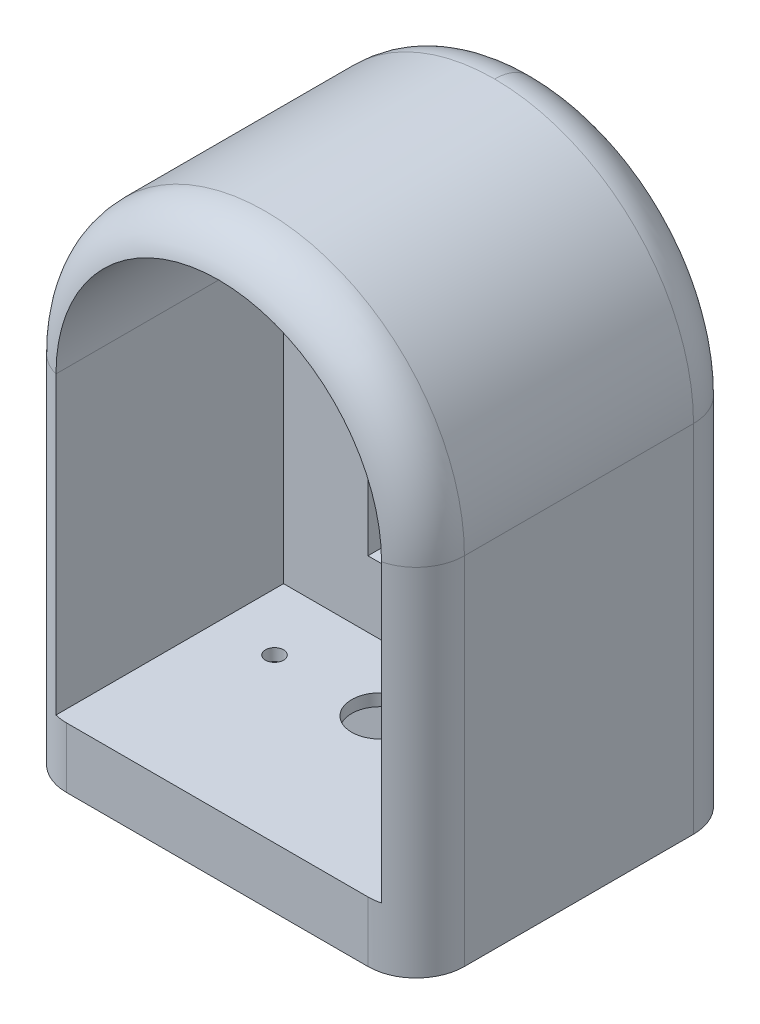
ISO-10303-21;
HEADER;
FILE_DESCRIPTION(('STEP AP214'),'2;1');
FILE_NAME('part.step','',(''),(''),'','','');
FILE_SCHEMA(('AUTOMOTIVE_DESIGN { 1 0 10303 214 1 1 1 1 }'));
ENDSEC;
DATA;
#1=APPLICATION_CONTEXT('core data for automotive mechanical design processes');
#2=APPLICATION_PROTOCOL_DEFINITION('international standard','automotive_design',2000,#1);
#3=PRODUCT_CONTEXT('',#1,'mechanical');
#4=PRODUCT('Part','Part','',(#3));
#5=PRODUCT_RELATED_PRODUCT_CATEGORY('part','',(#4));
#6=PRODUCT_DEFINITION_FORMATION('','',#4);
#7=PRODUCT_DEFINITION_CONTEXT('part definition',#1,'design');
#8=PRODUCT_DEFINITION('design','',#6,#7);
#9=PRODUCT_DEFINITION_SHAPE('','',#8);
#10=(LENGTH_UNIT() NAMED_UNIT(*) SI_UNIT(.MILLI.,.METRE.));
#11=(NAMED_UNIT(*) PLANE_ANGLE_UNIT() SI_UNIT($,.RADIAN.));
#12=(NAMED_UNIT(*) SI_UNIT($,.STERADIAN.) SOLID_ANGLE_UNIT());
#13=UNCERTAINTY_MEASURE_WITH_UNIT(LENGTH_MEASURE(1.E-05),#10,'distance_accuracy_value','');
#14=(GEOMETRIC_REPRESENTATION_CONTEXT(3) GLOBAL_UNCERTAINTY_ASSIGNED_CONTEXT((#13)) GLOBAL_UNIT_ASSIGNED_CONTEXT((#10,
#11,#12)) REPRESENTATION_CONTEXT('',''));
#15=CARTESIAN_POINT('',(0.,0.,0.));
#16=DIRECTION('',(0.,0.,1.));
#17=DIRECTION('',(1.,0.,0.));
#18=AXIS2_PLACEMENT_3D('',#15,#16,#17);
#19=CARTESIAN_POINT('',(-16.5,46.,-13.5));
#20=DIRECTION('',(0.,0.,1.));
#21=DIRECTION('',(1.,0.,0.));
#22=AXIS2_PLACEMENT_3D('',#19,#20,#21);
#23=PLANE('',#22);
#24=CARTESIAN_POINT('',(0.,36.35,-13.5));
#25=DIRECTION('',(0.,0.,1.));
#26=DIRECTION('',(1.,0.,0.));
#27=AXIS2_PLACEMENT_3D('',#24,#25,#26);
#28=CIRCLE('',#27,0.799999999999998);
#29=CARTESIAN_POINT('',(0.799999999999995,36.35,-13.5));
#30=VERTEX_POINT('',#29);
#31=EDGE_CURVE('E483',#30,#30,#28,.T.);
#32=ORIENTED_EDGE('',*,*,#31,.T.);
#33=EDGE_LOOP('',(#32));
#34=FACE_BOUND('',#33,.T.);
#35=CARTESIAN_POINT('',(0.,8.64999999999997,-13.5));
#36=DIRECTION('',(0.,0.,1.));
#37=DIRECTION('',(1.,0.,0.));
#38=AXIS2_PLACEMENT_3D('',#35,#36,#37);
#39=CIRCLE('',#38,0.799999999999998);
#40=CARTESIAN_POINT('',(0.799999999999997,8.64999999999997,-13.5));
#41=VERTEX_POINT('',#40);
#42=EDGE_CURVE('E489',#41,#41,#39,.T.);
#43=ORIENTED_EDGE('',*,*,#42,.T.);
#44=EDGE_LOOP('',(#43));
#45=FACE_BOUND('',#44,.T.);
#46=DIRECTION('',(-1.,0.,0.));
#47=VECTOR('',#46,1.);
#48=CARTESIAN_POINT('',(-16.5,0.,-13.5));
#49=LINE('',#48,#47);
#50=CARTESIAN_POINT('',(12.5,0.,-13.5));
#51=VERTEX_POINT('',#50);
#52=CARTESIAN_POINT('',(-12.5,0.,-13.5));
#53=VERTEX_POINT('',#52);
#54=EDGE_CURVE('E178',#51,#53,#49,.T.);
#55=ORIENTED_EDGE('',*,*,#54,.T.);
#56=DIRECTION('',(0.,-1.,0.));
#57=VECTOR('',#56,1.);
#58=CARTESIAN_POINT('',(-12.5,46.,-13.5));
#59=LINE('',#58,#57);
#60=CARTESIAN_POINT('',(-12.5,29.5,-13.5));
#61=VERTEX_POINT('',#60);
#62=EDGE_CURVE('E237',#53,#61,#59,.F.);
#63=ORIENTED_EDGE('',*,*,#62,.T.);
#64=CARTESIAN_POINT('',(0.,29.5,-13.5));
#65=DIRECTION('',(0.,0.,1.));
#66=DIRECTION('',(1.,0.,0.));
#67=AXIS2_PLACEMENT_3D('',#64,#65,#66);
#68=CIRCLE('',#67,12.5);
#69=CARTESIAN_POINT('',(0.,42.,-13.5));
#70=VERTEX_POINT('',#69);
#71=EDGE_CURVE('E228',#61,#70,#68,.F.);
#72=ORIENTED_EDGE('',*,*,#71,.T.);
#73=CARTESIAN_POINT('',(0.,29.5,-13.5));
#74=DIRECTION('',(0.,0.,1.));
#75=DIRECTION('',(1.,0.,0.));
#76=AXIS2_PLACEMENT_3D('',#73,#74,#75);
#77=CIRCLE('',#76,12.5);
#78=CARTESIAN_POINT('',(12.5,29.5,-13.5));
#79=VERTEX_POINT('',#78);
#80=EDGE_CURVE('E231',#70,#79,#77,.F.);
#81=ORIENTED_EDGE('',*,*,#80,.T.);
#82=DIRECTION('',(0.,-1.,0.));
#83=VECTOR('',#82,1.);
#84=CARTESIAN_POINT('',(12.5,46.,-13.5));
#85=LINE('',#84,#83);
#86=EDGE_CURVE('E234',#79,#51,#85,.T.);
#87=ORIENTED_EDGE('',*,*,#86,.T.);
#88=EDGE_LOOP('',(#55,#63,#72,#81,#87));
#89=FACE_BOUND('',#88,.T.);
#90=CARTESIAN_POINT('',(0.,28.,-13.5));
#91=DIRECTION('',(0.,0.,1.));
#92=DIRECTION('',(1.,0.,0.));
#93=AXIS2_PLACEMENT_3D('',#90,#91,#92);
#94=CIRCLE('',#93,6.49999999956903);
#95=CARTESIAN_POINT('',(2.59999999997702,22.0426515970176,-13.5));
#96=VERTEX_POINT('',#95);
#97=CARTESIAN_POINT('',(-2.59999999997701,22.0426515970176,-13.5));
#98=VERTEX_POINT('',#97);
#99=EDGE_CURVE('E131',#96,#98,#94,.T.);
#100=ORIENTED_EDGE('',*,*,#99,.T.);
#101=CARTESIAN_POINT('',(-3.,21.1261364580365,-13.5));
#102=DIRECTION('',(0.,0.,1.));
#103=DIRECTION('',(1.,0.,0.));
#104=AXIS2_PLACEMENT_3D('',#101,#102,#103);
#105=CIRCLE('',#104,1.);
#106=CARTESIAN_POINT('',(-2.,21.1261364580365,-13.5));
#107=VERTEX_POINT('',#106);
#108=EDGE_CURVE('E59',#98,#107,#105,.F.);
#109=ORIENTED_EDGE('',*,*,#108,.T.);
#110=DIRECTION('',(0.,1.,0.));
#111=VECTOR('',#110,1.);
#112=CARTESIAN_POINT('',(-1.99999999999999,46.,-13.5));
#113=LINE('',#112,#111);
#114=CARTESIAN_POINT('',(-2.,20.500000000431,-13.5));
#115=VERTEX_POINT('',#114);
#116=EDGE_CURVE('E338',#115,#107,#113,.T.);
#117=ORIENTED_EDGE('',*,*,#116,.F.);
#118=CARTESIAN_POINT('',(0.,20.500000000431,-13.5));
#119=DIRECTION('',(0.,0.,1.));
#120=DIRECTION('',(1.,0.,0.));
#121=AXIS2_PLACEMENT_3D('',#118,#119,#120);
#122=CIRCLE('',#121,2.);
#123=CARTESIAN_POINT('',(2.,20.500000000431,-13.5));
#124=VERTEX_POINT('',#123);
#125=EDGE_CURVE('E341',#124,#115,#122,.F.);
#126=ORIENTED_EDGE('',*,*,#125,.F.);
#127=DIRECTION('',(0.,-1.,0.));
#128=VECTOR('',#127,1.);
#129=CARTESIAN_POINT('',(2.00000000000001,46.,-13.5));
#130=LINE('',#129,#128);
#131=CARTESIAN_POINT('',(2.,21.1261364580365,-13.5));
#132=VERTEX_POINT('',#131);
#133=EDGE_CURVE('E135',#132,#124,#130,.T.);
#134=ORIENTED_EDGE('',*,*,#133,.F.);
#135=CARTESIAN_POINT('',(3.,21.1261364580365,-13.5));
#136=DIRECTION('',(0.,0.,1.));
#137=DIRECTION('',(1.,0.,0.));
#138=AXIS2_PLACEMENT_3D('',#135,#136,#137);
#139=CIRCLE('',#138,1.);
#140=EDGE_CURVE('E68',#132,#96,#139,.F.);
#141=ORIENTED_EDGE('',*,*,#140,.T.);
#142=EDGE_LOOP('',(#100,#109,#117,#126,#134,#141));
#143=FACE_BOUND('',#142,.T.);
#144=ADVANCED_FACE('F49',(#34,#45,#89,#143),#23,.F.);
#145=CARTESIAN_POINT('',(0.,0.,-10.5));
#146=DIRECTION('',(0.,0.,-1.));
#147=DIRECTION('',(-1.,0.,0.));
#148=AXIS2_PLACEMENT_3D('',#145,#146,#147);
#149=PLANE('',#148);
#150=DIRECTION('',(0.,-1.,0.));
#151=VECTOR('',#150,1.);
#152=CARTESIAN_POINT('',(-2.,0.,-10.5));
#153=LINE('',#152,#151);
#154=CARTESIAN_POINT('',(-2.,21.1261364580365,-10.5));
#155=VERTEX_POINT('',#154);
#156=CARTESIAN_POINT('',(-2.,20.500000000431,-10.5));
#157=VERTEX_POINT('',#156);
#158=EDGE_CURVE('E330',#155,#157,#153,.T.);
#159=ORIENTED_EDGE('',*,*,#158,.F.);
#160=CARTESIAN_POINT('',(-3.,21.1261364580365,-10.5));
#161=DIRECTION('',(0.,0.,-1.));
#162=DIRECTION('',(-1.,0.,0.));
#163=AXIS2_PLACEMENT_3D('',#160,#161,#162);
#164=CIRCLE('',#163,1.);
#165=CARTESIAN_POINT('',(-2.59999999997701,22.0426515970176,-10.5));
#166=VERTEX_POINT('',#165);
#167=EDGE_CURVE('E149',#155,#166,#164,.F.);
#168=ORIENTED_EDGE('',*,*,#167,.T.);
#169=CARTESIAN_POINT('',(0.,28.,-10.5));
#170=DIRECTION('',(0.,0.,-1.));
#171=DIRECTION('',(-1.,0.,0.));
#172=AXIS2_PLACEMENT_3D('',#169,#170,#171);
#173=CIRCLE('',#172,6.49999999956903);
#174=CARTESIAN_POINT('',(-6.5,28.,-10.5));
#175=VERTEX_POINT('',#174);
#176=EDGE_CURVE('E291',#175,#166,#173,.F.);
#177=ORIENTED_EDGE('',*,*,#176,.F.);
#178=DIRECTION('',(0.,-1.,0.));
#179=VECTOR('',#178,1.);
#180=CARTESIAN_POINT('',(-6.5,11.5,-10.5));
#181=LINE('',#180,#179);
#182=CARTESIAN_POINT('',(-6.5,10.5,-10.5));
#183=VERTEX_POINT('',#182);
#184=EDGE_CURVE('E301',#175,#183,#181,.T.);
#185=ORIENTED_EDGE('',*,*,#184,.T.);
#186=DIRECTION('',(1.,0.,0.));
#187=VECTOR('',#186,1.);
#188=CARTESIAN_POINT('',(6.5,10.5,-10.5));
#189=LINE('',#188,#187);
#190=CARTESIAN_POINT('',(6.5,10.5,-10.5));
#191=VERTEX_POINT('',#190);
#192=EDGE_CURVE('E473',#183,#191,#189,.T.);
#193=ORIENTED_EDGE('',*,*,#192,.T.);
#194=DIRECTION('',(0.,1.,0.));
#195=VECTOR('',#194,1.);
#196=CARTESIAN_POINT('',(6.5,11.5,-10.5));
#197=LINE('',#196,#195);
#198=CARTESIAN_POINT('',(6.5,28.,-10.5));
#199=VERTEX_POINT('',#198);
#200=EDGE_CURVE('E298',#191,#199,#197,.T.);
#201=ORIENTED_EDGE('',*,*,#200,.T.);
#202=CARTESIAN_POINT('',(2.59999999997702,22.0426515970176,-10.5));
#203=VERTEX_POINT('',#202);
#204=EDGE_CURVE('E293',#203,#199,#173,.F.);
#205=ORIENTED_EDGE('',*,*,#204,.F.);
#206=CARTESIAN_POINT('',(3.,21.1261364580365,-10.5));
#207=DIRECTION('',(0.,0.,-1.));
#208=DIRECTION('',(-1.,0.,0.));
#209=AXIS2_PLACEMENT_3D('',#206,#207,#208);
#210=CIRCLE('',#209,1.);
#211=CARTESIAN_POINT('',(2.,21.1261364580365,-10.5));
#212=VERTEX_POINT('',#211);
#213=EDGE_CURVE('E148',#203,#212,#210,.F.);
#214=ORIENTED_EDGE('',*,*,#213,.T.);
#215=DIRECTION('',(0.,1.,0.));
#216=VECTOR('',#215,1.);
#217=CARTESIAN_POINT('',(2.,0.,-10.5));
#218=LINE('',#217,#216);
#219=CARTESIAN_POINT('',(2.,20.500000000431,-10.5));
#220=VERTEX_POINT('',#219);
#221=EDGE_CURVE('E322',#220,#212,#218,.T.);
#222=ORIENTED_EDGE('',*,*,#221,.F.);
#223=CARTESIAN_POINT('',(0.,20.500000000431,-10.5));
#224=DIRECTION('',(0.,0.,-1.));
#225=DIRECTION('',(-1.,0.,0.));
#226=AXIS2_PLACEMENT_3D('',#223,#224,#225);
#227=CIRCLE('',#226,2.);
#228=EDGE_CURVE('E273',#157,#220,#227,.F.);
#229=ORIENTED_EDGE('',*,*,#228,.F.);
#230=EDGE_LOOP('',(#159,#168,#177,#185,#193,#201,#205,#214,#222,#229));
#231=FACE_BOUND('',#230,.T.);
#232=ADVANCED_FACE('F319',(#231),#149,.F.);
#233=CARTESIAN_POINT('',(0.,28.,-13.5));
#234=DIRECTION('',(0.,0.,1.));
#235=DIRECTION('',(1.,0.,0.));
#236=AXIS2_PLACEMENT_3D('',#233,#234,#235);
#237=CYLINDRICAL_SURFACE('',#236,6.49999999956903);
#238=ORIENTED_EDGE('',*,*,#176,.T.);
#239=DIRECTION('',(0.,0.,1.));
#240=VECTOR('',#239,1.);
#241=CARTESIAN_POINT('',(-2.59999999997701,22.0426515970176,-13.5));
#242=LINE('',#241,#240);
#243=EDGE_CURVE('E136',#166,#98,#242,.F.);
#244=ORIENTED_EDGE('',*,*,#243,.T.);
#245=ORIENTED_EDGE('',*,*,#99,.F.);
#246=DIRECTION('',(0.,0.,1.));
#247=VECTOR('',#246,1.);
#248=CARTESIAN_POINT('',(2.59999999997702,22.0426515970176,-13.5));
#249=LINE('',#248,#247);
#250=EDGE_CURVE('E140',#96,#203,#249,.T.);
#251=ORIENTED_EDGE('',*,*,#250,.T.);
#252=ORIENTED_EDGE('',*,*,#204,.T.);
#253=CARTESIAN_POINT('',(0.,28.,-10.5));
#254=DIRECTION('',(0.,0.,-1.));
#255=DIRECTION('',(-1.,0.,0.));
#256=AXIS2_PLACEMENT_3D('',#253,#254,#255);
#257=CIRCLE('',#256,6.49999999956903);
#258=CARTESIAN_POINT('',(0.,34.5,-10.5));
#259=VERTEX_POINT('',#258);
#260=EDGE_CURVE('E144',#199,#259,#257,.F.);
#261=ORIENTED_EDGE('',*,*,#260,.T.);
#262=CARTESIAN_POINT('',(0.,28.,-10.5));
#263=DIRECTION('',(0.,0.,-1.));
#264=DIRECTION('',(-1.,0.,0.));
#265=AXIS2_PLACEMENT_3D('',#262,#263,#264);
#266=CIRCLE('',#265,6.49999999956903);
#267=EDGE_CURVE('E103',#259,#175,#266,.F.);
#268=ORIENTED_EDGE('',*,*,#267,.T.);
#269=EDGE_LOOP('',(#238,#244,#245,#251,#252,#261,#268));
#270=FACE_BOUND('',#269,.T.);
#271=ADVANCED_FACE('F138',(#270),#237,.F.);
#272=CARTESIAN_POINT('',(-16.5,0.,-5.5));
#273=DIRECTION('',(0.,0.,1.));
#274=DIRECTION('',(0.,-1.,0.));
#275=AXIS2_PLACEMENT_3D('',#272,#273,#274);
#276=PLANE('',#275);
#277=DIRECTION('',(1.,0.,0.));
#278=VECTOR('',#277,1.);
#279=CARTESIAN_POINT('',(6.5,10.5,-5.5));
#280=LINE('',#279,#278);
#281=CARTESIAN_POINT('',(-6.5,10.5,-5.5));
#282=VERTEX_POINT('',#281);
#283=CARTESIAN_POINT('',(6.5,10.5,-5.5));
#284=VERTEX_POINT('',#283);
#285=EDGE_CURVE('E460',#282,#284,#280,.T.);
#286=ORIENTED_EDGE('',*,*,#285,.F.);
#287=DIRECTION('',(0.,-1.,0.));
#288=VECTOR('',#287,1.);
#289=CARTESIAN_POINT('',(-6.5,0.,-5.5));
#290=LINE('',#289,#288);
#291=CARTESIAN_POINT('',(-6.5,34.5,-5.5));
#292=VERTEX_POINT('',#291);
#293=EDGE_CURVE('E160',#292,#282,#290,.T.);
#294=ORIENTED_EDGE('',*,*,#293,.F.);
#295=DIRECTION('',(-1.,0.,0.));
#296=VECTOR('',#295,1.);
#297=CARTESIAN_POINT('',(-16.5,34.5,-5.5));
#298=LINE('',#297,#296);
#299=CARTESIAN_POINT('',(6.5,34.5,-5.5));
#300=VERTEX_POINT('',#299);
#301=EDGE_CURVE('E157',#300,#292,#298,.T.);
#302=ORIENTED_EDGE('',*,*,#301,.F.);
#303=DIRECTION('',(0.,1.,0.));
#304=VECTOR('',#303,1.);
#305=CARTESIAN_POINT('',(6.5,0.,-5.5));
#306=LINE('',#305,#304);
#307=EDGE_CURVE('E143',#284,#300,#306,.T.);
#308=ORIENTED_EDGE('',*,*,#307,.F.);
#309=EDGE_LOOP('',(#286,#294,#302,#308));
#310=FACE_BOUND('',#309,.T.);
#311=CARTESIAN_POINT('',(0.,36.35,-5.5));
#312=DIRECTION('',(0.,0.,1.));
#313=DIRECTION('',(1.,0.,0.));
#314=AXIS2_PLACEMENT_3D('',#311,#312,#313);
#315=CIRCLE('',#314,0.799999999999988);
#316=CARTESIAN_POINT('',(0.799999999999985,36.35,-5.5));
#317=VERTEX_POINT('',#316);
#318=EDGE_CURVE('E480',#317,#317,#315,.T.);
#319=ORIENTED_EDGE('',*,*,#318,.F.);
#320=EDGE_LOOP('',(#319));
#321=FACE_BOUND('',#320,.T.);
#322=CARTESIAN_POINT('',(0.,8.64999999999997,-5.5));
#323=DIRECTION('',(0.,0.,1.));
#324=DIRECTION('',(1.,0.,0.));
#325=AXIS2_PLACEMENT_3D('',#322,#323,#324);
#326=CIRCLE('',#325,0.799999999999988);
#327=CARTESIAN_POINT('',(0.799999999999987,8.64999999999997,-5.5));
#328=VERTEX_POINT('',#327);
#329=EDGE_CURVE('E486',#328,#328,#326,.T.);
#330=ORIENTED_EDGE('',*,*,#329,.F.);
#331=EDGE_LOOP('',(#330));
#332=FACE_BOUND('',#331,.T.);
#333=CARTESIAN_POINT('',(0.,29.5,-5.5));
#334=DIRECTION('',(0.,0.,1.));
#335=DIRECTION('',(0.,-1.,0.));
#336=AXIS2_PLACEMENT_3D('',#333,#334,#335);
#337=CIRCLE('',#336,13.5);
#338=CARTESIAN_POINT('',(-13.5,29.5,-5.5));
#339=VERTEX_POINT('',#338);
#340=CARTESIAN_POINT('',(13.5,29.5,-5.5));
#341=VERTEX_POINT('',#340);
#342=EDGE_CURVE('E164',#339,#341,#337,.F.);
#343=ORIENTED_EDGE('',*,*,#342,.F.);
#344=DIRECTION('',(0.,1.,0.));
#345=VECTOR('',#344,1.);
#346=CARTESIAN_POINT('',(-13.5,29.5,-5.5));
#347=LINE('',#346,#345);
#348=CARTESIAN_POINT('',(-13.5,5.,-5.5));
#349=VERTEX_POINT('',#348);
#350=EDGE_CURVE('E53',#349,#339,#347,.T.);
#351=ORIENTED_EDGE('',*,*,#350,.F.);
#352=DIRECTION('',(1.,0.,0.));
#353=VECTOR('',#352,1.);
#354=CARTESIAN_POINT('',(-16.5,5.,-5.5));
#355=LINE('',#354,#353);
#356=CARTESIAN_POINT('',(13.5,5.,-5.5));
#357=VERTEX_POINT('',#356);
#358=EDGE_CURVE('E170',#349,#357,#355,.T.);
#359=ORIENTED_EDGE('',*,*,#358,.T.);
#360=DIRECTION('',(0.,-1.,0.));
#361=VECTOR('',#360,1.);
#362=CARTESIAN_POINT('',(13.5,5.,-5.5));
#363=LINE('',#362,#361);
#364=EDGE_CURVE('E167',#341,#357,#363,.T.);
#365=ORIENTED_EDGE('',*,*,#364,.F.);
#366=EDGE_LOOP('',(#343,#351,#359,#365));
#367=FACE_BOUND('',#366,.T.);
#368=ADVANCED_FACE('F51',(#310,#321,#332,#367),#276,.T.);
#369=CARTESIAN_POINT('',(-16.5,5.,0.));
#370=DIRECTION('',(0.,-1.,0.));
#371=DIRECTION('',(0.,0.,-1.));
#372=AXIS2_PLACEMENT_3D('',#369,#370,#371);
#373=PLANE('',#372);
#374=CARTESIAN_POINT('',(-8.75,5.,0.));
#375=DIRECTION('',(0.,-1.,0.));
#376=DIRECTION('',(0.,0.,-1.));
#377=AXIS2_PLACEMENT_3D('',#374,#375,#376);
#378=CIRCLE('',#377,0.75);
#379=CARTESIAN_POINT('',(-8.75,5.,-0.750000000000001));
#380=VERTEX_POINT('',#379);
#381=EDGE_CURVE('E353',#380,#380,#378,.T.);
#382=ORIENTED_EDGE('',*,*,#381,.T.);
#383=EDGE_LOOP('',(#382));
#384=FACE_BOUND('',#383,.T.);
#385=CARTESIAN_POINT('',(8.75,5.,0.));
#386=DIRECTION('',(0.,-1.,0.));
#387=DIRECTION('',(0.,0.,-1.));
#388=AXIS2_PLACEMENT_3D('',#385,#386,#387);
#389=CIRCLE('',#388,0.75);
#390=CARTESIAN_POINT('',(8.75,5.,-0.75));
#391=VERTEX_POINT('',#390);
#392=EDGE_CURVE('E348',#391,#391,#389,.T.);
#393=ORIENTED_EDGE('',*,*,#392,.T.);
#394=EDGE_LOOP('',(#393));
#395=FACE_BOUND('',#394,.T.);
#396=CARTESIAN_POINT('',(0.,5.,0.));
#397=DIRECTION('',(0.,1.,0.));
#398=DIRECTION('',(0.,0.,1.));
#399=AXIS2_PLACEMENT_3D('',#396,#397,#398);
#400=CIRCLE('',#399,2.35);
#401=CARTESIAN_POINT('',(0.,5.,2.35));
#402=VERTEX_POINT('',#401);
#403=EDGE_CURVE('E356',#402,#402,#400,.T.);
#404=ORIENTED_EDGE('',*,*,#403,.F.);
#405=EDGE_LOOP('',(#404));
#406=FACE_BOUND('',#405,.T.);
#407=DIRECTION('',(1.,0.,0.));
#408=VECTOR('',#407,1.);
#409=CARTESIAN_POINT('',(-16.5,5.,13.5));
#410=LINE('',#409,#408);
#411=CARTESIAN_POINT('',(-12.5,5.,13.5));
#412=VERTEX_POINT('',#411);
#413=CARTESIAN_POINT('',(12.5,5.,13.5));
#414=VERTEX_POINT('',#413);
#415=EDGE_CURVE('E173',#412,#414,#410,.T.);
#416=ORIENTED_EDGE('',*,*,#415,.T.);
#417=CARTESIAN_POINT('',(12.5,5.,9.5));
#418=DIRECTION('',(0.,-1.,0.));
#419=DIRECTION('',(0.,0.,-1.));
#420=AXIS2_PLACEMENT_3D('',#417,#418,#419);
#421=CIRCLE('',#420,4.);
#422=CARTESIAN_POINT('',(13.5,5.,13.3729833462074));
#423=VERTEX_POINT('',#422);
#424=EDGE_CURVE('E263',#414,#423,#421,.F.);
#425=ORIENTED_EDGE('',*,*,#424,.T.);
#426=DIRECTION('',(0.,0.,-1.));
#427=VECTOR('',#426,1.);
#428=CARTESIAN_POINT('',(13.5,5.,13.5));
#429=LINE('',#428,#427);
#430=EDGE_CURVE('E169',#423,#357,#429,.T.);
#431=ORIENTED_EDGE('',*,*,#430,.T.);
#432=ORIENTED_EDGE('',*,*,#358,.F.);
#433=DIRECTION('',(0.,0.,-1.));
#434=VECTOR('',#433,1.);
#435=CARTESIAN_POINT('',(-13.5,5.,13.5));
#436=LINE('',#435,#434);
#437=CARTESIAN_POINT('',(-13.5,5.,13.3729833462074));
#438=VERTEX_POINT('',#437);
#439=EDGE_CURVE('E95',#438,#349,#436,.T.);
#440=ORIENTED_EDGE('',*,*,#439,.F.);
#441=CARTESIAN_POINT('',(-12.5,5.,9.5));
#442=DIRECTION('',(0.,-1.,0.));
#443=DIRECTION('',(0.,0.,-1.));
#444=AXIS2_PLACEMENT_3D('',#441,#442,#443);
#445=CIRCLE('',#444,4.);
#446=EDGE_CURVE('E261',#438,#412,#445,.F.);
#447=ORIENTED_EDGE('',*,*,#446,.T.);
#448=EDGE_LOOP('',(#416,#425,#431,#432,#440,#447));
#449=FACE_BOUND('',#448,.T.);
#450=ADVANCED_FACE('F503',(#384,#395,#406,#449),#373,.F.);
#451=ORIENTED_EDGE('',*,*,#260,.F.);
#452=DIRECTION('',(0.,1.,0.));
#453=VECTOR('',#452,1.);
#454=CARTESIAN_POINT('',(6.5,11.5,-10.5));
#455=LINE('',#454,#453);
#456=CARTESIAN_POINT('',(6.5,34.5,-10.5));
#457=VERTEX_POINT('',#456);
#458=EDGE_CURVE('E163',#199,#457,#455,.T.);
#459=ORIENTED_EDGE('',*,*,#458,.T.);
#460=DIRECTION('',(-1.,0.,0.));
#461=VECTOR('',#460,1.);
#462=CARTESIAN_POINT('',(-6.5,34.5,-10.5));
#463=LINE('',#462,#461);
#464=EDGE_CURVE('E297',#457,#259,#463,.T.);
#465=ORIENTED_EDGE('',*,*,#464,.T.);
#466=EDGE_LOOP('',(#451,#459,#465));
#467=FACE_BOUND('',#466,.T.);
#468=ADVANCED_FACE('F583',(#467),#149,.F.);
#469=ORIENTED_EDGE('',*,*,#267,.F.);
#470=DIRECTION('',(-1.,0.,0.));
#471=VECTOR('',#470,1.);
#472=CARTESIAN_POINT('',(-6.5,34.5,-10.5));
#473=LINE('',#472,#471);
#474=CARTESIAN_POINT('',(-6.5,34.5,-10.5));
#475=VERTEX_POINT('',#474);
#476=EDGE_CURVE('E295',#259,#475,#473,.T.);
#477=ORIENTED_EDGE('',*,*,#476,.T.);
#478=DIRECTION('',(0.,-1.,0.));
#479=VECTOR('',#478,1.);
#480=CARTESIAN_POINT('',(-6.5,11.5,-10.5));
#481=LINE('',#480,#479);
#482=EDGE_CURVE('E308',#475,#175,#481,.T.);
#483=ORIENTED_EDGE('',*,*,#482,.T.);
#484=EDGE_LOOP('',(#469,#477,#483));
#485=FACE_BOUND('',#484,.T.);
#486=ADVANCED_FACE('F674',(#485),#149,.F.);
#487=CARTESIAN_POINT('',(16.5,46.,13.5));
#488=DIRECTION('',(-1.,0.,0.));
#489=DIRECTION('',(0.,0.,1.));
#490=AXIS2_PLACEMENT_3D('',#487,#488,#489);
#491=PLANE('',#490);
#492=DIRECTION('',(0.,0.,-1.));
#493=VECTOR('',#492,1.);
#494=CARTESIAN_POINT('',(16.5,0.,13.5));
#495=LINE('',#494,#493);
#496=CARTESIAN_POINT('',(16.5,0.,9.5));
#497=VERTEX_POINT('',#496);
#498=CARTESIAN_POINT('',(16.5,0.,-9.5));
#499=VERTEX_POINT('',#498);
#500=EDGE_CURVE('E172',#497,#499,#495,.T.);
#501=ORIENTED_EDGE('',*,*,#500,.T.);
#502=DIRECTION('',(0.,-1.,0.));
#503=VECTOR('',#502,1.);
#504=CARTESIAN_POINT('',(16.5,46.,-9.5));
#505=LINE('',#504,#503);
#506=CARTESIAN_POINT('',(16.5,29.5,-9.5));
#507=VERTEX_POINT('',#506);
#508=EDGE_CURVE('E243',#499,#507,#505,.F.);
#509=ORIENTED_EDGE('',*,*,#508,.T.);
#510=DIRECTION('',(0.,0.,-1.));
#511=VECTOR('',#510,1.);
#512=CARTESIAN_POINT('',(16.5,29.5,13.5));
#513=LINE('',#512,#511);
#514=CARTESIAN_POINT('',(16.5,29.5,9.5));
#515=VERTEX_POINT('',#514);
#516=EDGE_CURVE('E207',#507,#515,#513,.F.);
#517=ORIENTED_EDGE('',*,*,#516,.T.);
#518=DIRECTION('',(0.,-1.,0.));
#519=VECTOR('',#518,1.);
#520=CARTESIAN_POINT('',(16.5,46.,9.5));
#521=LINE('',#520,#519);
#522=EDGE_CURVE('E240',#515,#497,#521,.T.);
#523=ORIENTED_EDGE('',*,*,#522,.T.);
#524=EDGE_LOOP('',(#501,#509,#517,#523));
#525=FACE_BOUND('',#524,.T.);
#526=ADVANCED_FACE('F539',(#525),#491,.F.);
#527=CARTESIAN_POINT('',(-16.5,46.,13.5));
#528=DIRECTION('',(1.,0.,0.));
#529=DIRECTION('',(0.,0.,-1.));
#530=AXIS2_PLACEMENT_3D('',#527,#528,#529);
#531=PLANE('',#530);
#532=DIRECTION('',(0.,0.,1.));
#533=VECTOR('',#532,1.);
#534=CARTESIAN_POINT('',(-16.5,29.5,13.5));
#535=LINE('',#534,#533);
#536=CARTESIAN_POINT('',(-16.5,29.5,9.5));
#537=VERTEX_POINT('',#536);
#538=CARTESIAN_POINT('',(-16.5,29.5,-9.5));
#539=VERTEX_POINT('',#538);
#540=EDGE_CURVE('E204',#537,#539,#535,.F.);
#541=ORIENTED_EDGE('',*,*,#540,.T.);
#542=DIRECTION('',(0.,-1.,0.));
#543=VECTOR('',#542,1.);
#544=CARTESIAN_POINT('',(-16.5,46.,-9.5));
#545=LINE('',#544,#543);
#546=CARTESIAN_POINT('',(-16.5,0.,-9.5));
#547=VERTEX_POINT('',#546);
#548=EDGE_CURVE('E213',#539,#547,#545,.T.);
#549=ORIENTED_EDGE('',*,*,#548,.T.);
#550=DIRECTION('',(0.,0.,1.));
#551=VECTOR('',#550,1.);
#552=CARTESIAN_POINT('',(-16.5,0.,13.5));
#553=LINE('',#552,#551);
#554=CARTESIAN_POINT('',(-16.5,0.,9.5));
#555=VERTEX_POINT('',#554);
#556=EDGE_CURVE('E198',#547,#555,#553,.T.);
#557=ORIENTED_EDGE('',*,*,#556,.T.);
#558=DIRECTION('',(0.,-1.,0.));
#559=VECTOR('',#558,1.);
#560=CARTESIAN_POINT('',(-16.5,46.,9.5));
#561=LINE('',#560,#559);
#562=EDGE_CURVE('E209',#555,#537,#561,.F.);
#563=ORIENTED_EDGE('',*,*,#562,.T.);
#564=EDGE_LOOP('',(#541,#549,#557,#563));
#565=FACE_BOUND('',#564,.T.);
#566=ADVANCED_FACE('F643',(#565),#531,.F.);
#567=CARTESIAN_POINT('',(-16.5,46.,13.5));
#568=DIRECTION('',(0.,0.,-1.));
#569=DIRECTION('',(-1.,0.,0.));
#570=AXIS2_PLACEMENT_3D('',#567,#568,#569);
#571=PLANE('',#570);
#572=DIRECTION('',(1.,0.,0.));
#573=VECTOR('',#572,1.);
#574=CARTESIAN_POINT('',(-16.5,0.,13.5));
#575=LINE('',#574,#573);
#576=CARTESIAN_POINT('',(-12.5,0.,13.5));
#577=VERTEX_POINT('',#576);
#578=CARTESIAN_POINT('',(12.5,0.,13.5));
#579=VERTEX_POINT('',#578);
#580=EDGE_CURVE('E201',#577,#579,#575,.T.);
#581=ORIENTED_EDGE('',*,*,#580,.T.);
#582=DIRECTION('',(0.,-1.,0.));
#583=VECTOR('',#582,1.);
#584=CARTESIAN_POINT('',(12.5,46.,13.5));
#585=LINE('',#584,#583);
#586=EDGE_CURVE('E258',#579,#414,#585,.F.);
#587=ORIENTED_EDGE('',*,*,#586,.T.);
#588=ORIENTED_EDGE('',*,*,#415,.F.);
#589=DIRECTION('',(0.,-1.,0.));
#590=VECTOR('',#589,1.);
#591=CARTESIAN_POINT('',(-12.5,46.,13.5));
#592=LINE('',#591,#590);
#593=EDGE_CURVE('E255',#412,#577,#592,.T.);
#594=ORIENTED_EDGE('',*,*,#593,.T.);
#595=EDGE_LOOP('',(#581,#587,#588,#594));
#596=FACE_BOUND('',#595,.T.);
#597=ADVANCED_FACE('F686',(#596),#571,.F.);
#598=CARTESIAN_POINT('',(0.,0.,0.));
#599=DIRECTION('',(0.,-1.,0.));
#600=DIRECTION('',(0.,0.,-1.));
#601=AXIS2_PLACEMENT_3D('',#598,#599,#600);
#602=PLANE('',#601);
#603=CARTESIAN_POINT('',(0.,0.,0.));
#604=DIRECTION('',(0.,-1.,0.));
#605=DIRECTION('',(0.,0.,-1.));
#606=AXIS2_PLACEMENT_3D('',#603,#604,#605);
#607=CIRCLE('',#606,2.5);
#608=CARTESIAN_POINT('',(0.133928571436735,0.,2.49641005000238));
#609=VERTEX_POINT('',#608);
#610=CARTESIAN_POINT('',(-0.133928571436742,0.,2.49641005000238));
#611=VERTEX_POINT('',#610);
#612=EDGE_CURVE('E360',#609,#611,#607,.T.);
#613=ORIENTED_EDGE('',*,*,#612,.F.);
#614=DIRECTION('',(0.998564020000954,0.,-0.0535714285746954));
#615=VECTOR('',#614,1.);
#616=CARTESIAN_POINT('',(0.133928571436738,0.,2.49641005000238));
#617=LINE('',#616,#615);
#618=CARTESIAN_POINT('',(14.0937500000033,0.,1.747487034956));
#619=VERTEX_POINT('',#618);
#620=EDGE_CURVE('E367',#609,#619,#617,.T.);
#621=ORIENTED_EDGE('',*,*,#620,.T.);
#622=CARTESIAN_POINT('',(14.,0.,0.));
#623=DIRECTION('',(0.,-1.,0.));
#624=DIRECTION('',(0.,0.,-1.));
#625=AXIS2_PLACEMENT_3D('',#622,#623,#624);
#626=CIRCLE('',#625,1.74999999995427);
#627=CARTESIAN_POINT('',(14.0937500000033,0.,-1.747487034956));
#628=VERTEX_POINT('',#627);
#629=EDGE_CURVE('E406',#628,#619,#626,.T.);
#630=ORIENTED_EDGE('',*,*,#629,.F.);
#631=DIRECTION('',(0.998564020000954,0.,0.0535714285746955));
#632=VECTOR('',#631,1.);
#633=CARTESIAN_POINT('',(0.133928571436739,0.,-2.49641005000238));
#634=LINE('',#633,#632);
#635=CARTESIAN_POINT('',(0.133928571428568,0.,-2.49641005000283));
#636=VERTEX_POINT('',#635);
#637=EDGE_CURVE('E403',#636,#628,#634,.T.);
#638=ORIENTED_EDGE('',*,*,#637,.F.);
#639=CARTESIAN_POINT('',(0.,0.,0.));
#640=DIRECTION('',(0.,-1.,0.));
#641=DIRECTION('',(0.,0.,-1.));
#642=AXIS2_PLACEMENT_3D('',#639,#640,#641);
#643=CIRCLE('',#642,2.5);
#644=CARTESIAN_POINT('',(-0.133928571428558,0.,-2.49641005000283));
#645=VERTEX_POINT('',#644);
#646=EDGE_CURVE('E400',#645,#636,#643,.T.);
#647=ORIENTED_EDGE('',*,*,#646,.F.);
#648=DIRECTION('',(-0.998564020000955,0.,0.0535714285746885));
#649=VECTOR('',#648,1.);
#650=CARTESIAN_POINT('',(-0.133928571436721,0.,-2.49641005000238));
#651=LINE('',#650,#649);
#652=CARTESIAN_POINT('',(-14.0937500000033,0.,-1.7474870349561));
#653=VERTEX_POINT('',#652);
#654=EDGE_CURVE('E397',#645,#653,#651,.T.);
#655=ORIENTED_EDGE('',*,*,#654,.T.);
#656=CARTESIAN_POINT('',(-14.,0.,0.));
#657=DIRECTION('',(0.,-1.,0.));
#658=DIRECTION('',(0.,0.,-1.));
#659=AXIS2_PLACEMENT_3D('',#656,#657,#658);
#660=CIRCLE('',#659,1.74999999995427);
#661=CARTESIAN_POINT('',(-14.0937500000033,0.,1.7474870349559));
#662=VERTEX_POINT('',#661);
#663=EDGE_CURVE('E394',#653,#662,#660,.F.);
#664=ORIENTED_EDGE('',*,*,#663,.T.);
#665=DIRECTION('',(-0.998564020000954,0.,-0.0535714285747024));
#666=VECTOR('',#665,1.);
#667=CARTESIAN_POINT('',(-0.133928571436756,0.,2.49641005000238));
#668=LINE('',#667,#666);
#669=EDGE_CURVE('E391',#611,#662,#668,.T.);
#670=ORIENTED_EDGE('',*,*,#669,.F.);
#671=EDGE_LOOP('',(#613,#621,#630,#638,#647,#655,#664,#670));
#672=FACE_BOUND('',#671,.T.);
#673=ORIENTED_EDGE('',*,*,#556,.F.);
#674=CARTESIAN_POINT('',(-12.5,0.,-9.5));
#675=DIRECTION('',(0.,-1.,0.));
#676=DIRECTION('',(0.,0.,-1.));
#677=AXIS2_PLACEMENT_3D('',#674,#675,#676);
#678=CIRCLE('',#677,4.);
#679=EDGE_CURVE('E225',#547,#53,#678,.T.);
#680=ORIENTED_EDGE('',*,*,#679,.T.);
#681=ORIENTED_EDGE('',*,*,#54,.F.);
#682=CARTESIAN_POINT('',(12.5,0.,-9.5));
#683=DIRECTION('',(0.,-1.,0.));
#684=DIRECTION('',(0.,0.,-1.));
#685=AXIS2_PLACEMENT_3D('',#682,#683,#684);
#686=CIRCLE('',#685,4.);
#687=EDGE_CURVE('E222',#51,#499,#686,.T.);
#688=ORIENTED_EDGE('',*,*,#687,.T.);
#689=ORIENTED_EDGE('',*,*,#500,.F.);
#690=CARTESIAN_POINT('',(12.5,0.,9.5));
#691=DIRECTION('',(0.,-1.,0.));
#692=DIRECTION('',(0.,0.,-1.));
#693=AXIS2_PLACEMENT_3D('',#690,#691,#692);
#694=CIRCLE('',#693,4.);
#695=EDGE_CURVE('E219',#497,#579,#694,.T.);
#696=ORIENTED_EDGE('',*,*,#695,.T.);
#697=ORIENTED_EDGE('',*,*,#580,.F.);
#698=CARTESIAN_POINT('',(-12.5,0.,9.5));
#699=DIRECTION('',(0.,-1.,0.));
#700=DIRECTION('',(0.,0.,-1.));
#701=AXIS2_PLACEMENT_3D('',#698,#699,#700);
#702=CIRCLE('',#701,4.);
#703=EDGE_CURVE('E216',#577,#555,#702,.T.);
#704=ORIENTED_EDGE('',*,*,#703,.T.);
#705=EDGE_LOOP('',(#673,#680,#681,#688,#689,#696,#697,#704));
#706=FACE_BOUND('',#705,.T.);
#707=ADVANCED_FACE('F641',(#672,#706),#602,.T.);
#708=CARTESIAN_POINT('',(0.,29.5,0.));
#709=DIRECTION('',(0.,0.,-1.));
#710=DIRECTION('',(-1.,0.,0.));
#711=AXIS2_PLACEMENT_3D('',#708,#709,#710);
#712=CYLINDRICAL_SURFACE('',#711,16.5);
#713=ORIENTED_EDGE('',*,*,#540,.F.);
#714=CARTESIAN_POINT('',(0.,29.5,9.5));
#715=DIRECTION('',(0.,0.,-1.));
#716=DIRECTION('',(-1.,0.,0.));
#717=AXIS2_PLACEMENT_3D('',#714,#715,#716);
#718=CIRCLE('',#717,16.5);
#719=EDGE_CURVE('E252',#537,#515,#718,.T.);
#720=ORIENTED_EDGE('',*,*,#719,.T.);
#721=ORIENTED_EDGE('',*,*,#516,.F.);
#722=CARTESIAN_POINT('',(0.,29.5,-9.5));
#723=DIRECTION('',(0.,0.,1.));
#724=DIRECTION('',(1.,0.,0.));
#725=AXIS2_PLACEMENT_3D('',#722,#723,#724);
#726=CIRCLE('',#725,16.5);
#727=CARTESIAN_POINT('',(0.,46.,-9.5));
#728=VERTEX_POINT('',#727);
#729=EDGE_CURVE('E249',#507,#728,#726,.T.);
#730=ORIENTED_EDGE('',*,*,#729,.T.);
#731=DIRECTION('',(0.,0.,-1.));
#732=VECTOR('',#731,1.);
#733=CARTESIAN_POINT('',(0.,46.,0.));
#734=LINE('',#733,#732);
#735=CARTESIAN_POINT('',(0.,46.,-3.));
#736=VERTEX_POINT('',#735);
#737=EDGE_CURVE('E181',#736,#728,#734,.T.);
#738=ORIENTED_EDGE('',*,*,#737,.F.);
#739=ORIENTED_EDGE('',*,*,#737,.T.);
#740=CARTESIAN_POINT('',(0.,29.5,-9.5));
#741=DIRECTION('',(0.,0.,1.));
#742=DIRECTION('',(1.,0.,0.));
#743=AXIS2_PLACEMENT_3D('',#740,#741,#742);
#744=CIRCLE('',#743,16.5);
#745=EDGE_CURVE('E246',#728,#539,#744,.T.);
#746=ORIENTED_EDGE('',*,*,#745,.T.);
#747=EDGE_LOOP('',(#713,#720,#721,#730,#738,#739,#746));
#748=FACE_BOUND('',#747,.T.);
#749=ADVANCED_FACE('F533',(#748),#712,.T.);
#750=CARTESIAN_POINT('',(6.5,11.5,-12.));
#751=DIRECTION('',(1.,0.,0.));
#752=DIRECTION('',(0.,0.,-1.));
#753=AXIS2_PLACEMENT_3D('',#750,#751,#752);
#754=PLANE('',#753);
#755=ORIENTED_EDGE('',*,*,#307,.T.);
#756=DIRECTION('',(0.,0.,1.));
#757=VECTOR('',#756,1.);
#758=CARTESIAN_POINT('',(6.5,34.5,-12.));
#759=LINE('',#758,#757);
#760=EDGE_CURVE('E193',#457,#300,#759,.T.);
#761=ORIENTED_EDGE('',*,*,#760,.F.);
#762=ORIENTED_EDGE('',*,*,#458,.F.);
#763=ORIENTED_EDGE('',*,*,#200,.F.);
#764=DIRECTION('',(0.,0.,1.));
#765=VECTOR('',#764,1.);
#766=CARTESIAN_POINT('',(6.5,10.5,-23.5384048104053));
#767=LINE('',#766,#765);
#768=EDGE_CURVE('E475',#191,#284,#767,.T.);
#769=ORIENTED_EDGE('',*,*,#768,.T.);
#770=EDGE_LOOP('',(#755,#761,#762,#763,#769));
#771=FACE_BOUND('',#770,.T.);
#772=ADVANCED_FACE('F585',(#771),#754,.F.);
#773=CARTESIAN_POINT('',(-6.5,11.5,-12.));
#774=DIRECTION('',(-1.,0.,0.));
#775=DIRECTION('',(0.,0.,1.));
#776=AXIS2_PLACEMENT_3D('',#773,#774,#775);
#777=PLANE('',#776);
#778=ORIENTED_EDGE('',*,*,#293,.T.);
#779=DIRECTION('',(0.,0.,1.));
#780=VECTOR('',#779,1.);
#781=CARTESIAN_POINT('',(-6.5,10.5,-23.5384048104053));
#782=LINE('',#781,#780);
#783=EDGE_CURVE('E466',#183,#282,#782,.T.);
#784=ORIENTED_EDGE('',*,*,#783,.F.);
#785=ORIENTED_EDGE('',*,*,#184,.F.);
#786=ORIENTED_EDGE('',*,*,#482,.F.);
#787=DIRECTION('',(0.,0.,1.));
#788=VECTOR('',#787,1.);
#789=CARTESIAN_POINT('',(-6.5,34.5,-12.));
#790=LINE('',#789,#788);
#791=EDGE_CURVE('E190',#475,#292,#790,.T.);
#792=ORIENTED_EDGE('',*,*,#791,.T.);
#793=EDGE_LOOP('',(#778,#784,#785,#786,#792));
#794=FACE_BOUND('',#793,.T.);
#795=ADVANCED_FACE('F463',(#794),#777,.F.);
#796=CARTESIAN_POINT('',(-6.5,34.5,-12.));
#797=DIRECTION('',(0.,1.,0.));
#798=DIRECTION('',(0.,0.,1.));
#799=AXIS2_PLACEMENT_3D('',#796,#797,#798);
#800=PLANE('',#799);
#801=ORIENTED_EDGE('',*,*,#301,.T.);
#802=ORIENTED_EDGE('',*,*,#791,.F.);
#803=ORIENTED_EDGE('',*,*,#476,.F.);
#804=ORIENTED_EDGE('',*,*,#464,.F.);
#805=ORIENTED_EDGE('',*,*,#760,.T.);
#806=EDGE_LOOP('',(#801,#802,#803,#804,#805));
#807=FACE_BOUND('',#806,.T.);
#808=ADVANCED_FACE('F447',(#807),#800,.F.);
#809=CARTESIAN_POINT('',(-13.5,29.5,13.5));
#810=DIRECTION('',(-1.,0.,0.));
#811=DIRECTION('',(0.,0.,1.));
#812=AXIS2_PLACEMENT_3D('',#809,#810,#811);
#813=PLANE('',#812);
#814=DIRECTION('',(0.,0.,-1.));
#815=VECTOR('',#814,1.);
#816=CARTESIAN_POINT('',(-13.5,29.5,13.5));
#817=LINE('',#816,#815);
#818=CARTESIAN_POINT('',(-13.5,29.5,13.3729833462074));
#819=VERTEX_POINT('',#818);
#820=EDGE_CURVE('E436',#819,#339,#817,.T.);
#821=ORIENTED_EDGE('',*,*,#820,.F.);
#822=DIRECTION('',(0.,-1.,0.));
#823=VECTOR('',#822,1.);
#824=CARTESIAN_POINT('',(-13.5,46.,13.3729833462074));
#825=LINE('',#824,#823);
#826=EDGE_CURVE('E271',#819,#438,#825,.T.);
#827=ORIENTED_EDGE('',*,*,#826,.T.);
#828=ORIENTED_EDGE('',*,*,#439,.T.);
#829=ORIENTED_EDGE('',*,*,#350,.T.);
#830=EDGE_LOOP('',(#821,#827,#828,#829));
#831=FACE_BOUND('',#830,.T.);
#832=ADVANCED_FACE('F509',(#831),#813,.F.);
#833=CARTESIAN_POINT('',(0.,29.5,13.5));
#834=DIRECTION('',(0.,0.,-1.));
#835=DIRECTION('',(-1.,0.,0.));
#836=AXIS2_PLACEMENT_3D('',#833,#834,#835);
#837=CYLINDRICAL_SURFACE('',#836,13.5);
#838=DIRECTION('',(0.,0.,-1.));
#839=VECTOR('',#838,1.);
#840=CARTESIAN_POINT('',(13.5,29.5,13.5));
#841=LINE('',#840,#839);
#842=CARTESIAN_POINT('',(13.5,29.5,13.3729833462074));
#843=VERTEX_POINT('',#842);
#844=EDGE_CURVE('E434',#843,#341,#841,.T.);
#845=ORIENTED_EDGE('',*,*,#844,.F.);
#846=CARTESIAN_POINT('',(0.,29.5,13.3729833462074));
#847=DIRECTION('',(0.,0.,-1.));
#848=DIRECTION('',(-1.,0.,0.));
#849=AXIS2_PLACEMENT_3D('',#846,#847,#848);
#850=CIRCLE('',#849,13.5);
#851=EDGE_CURVE('E268',#843,#819,#850,.F.);
#852=ORIENTED_EDGE('',*,*,#851,.T.);
#853=ORIENTED_EDGE('',*,*,#820,.T.);
#854=ORIENTED_EDGE('',*,*,#342,.T.);
#855=EDGE_LOOP('',(#845,#852,#853,#854));
#856=FACE_BOUND('',#855,.T.);
#857=ADVANCED_FACE('F706',(#856),#837,.F.);
#858=CARTESIAN_POINT('',(13.5,5.,13.5));
#859=DIRECTION('',(1.,0.,0.));
#860=DIRECTION('',(0.,0.,-1.));
#861=AXIS2_PLACEMENT_3D('',#858,#859,#860);
#862=PLANE('',#861);
#863=ORIENTED_EDGE('',*,*,#430,.F.);
#864=DIRECTION('',(0.,-1.,0.));
#865=VECTOR('',#864,1.);
#866=CARTESIAN_POINT('',(13.5,46.,13.3729833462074));
#867=LINE('',#866,#865);
#868=EDGE_CURVE('E265',#423,#843,#867,.F.);
#869=ORIENTED_EDGE('',*,*,#868,.T.);
#870=ORIENTED_EDGE('',*,*,#844,.T.);
#871=ORIENTED_EDGE('',*,*,#364,.T.);
#872=EDGE_LOOP('',(#863,#869,#870,#871));
#873=FACE_BOUND('',#872,.T.);
#874=ADVANCED_FACE('F709',(#873),#862,.F.);
#875=CARTESIAN_POINT('',(12.5,46.,-9.5));
#876=DIRECTION('',(0.,-1.,0.));
#877=DIRECTION('',(0.,0.,-1.));
#878=AXIS2_PLACEMENT_3D('',#875,#876,#877);
#879=CYLINDRICAL_SURFACE('',#878,4.);
#880=ORIENTED_EDGE('',*,*,#687,.F.);
#881=ORIENTED_EDGE('',*,*,#86,.F.);
#882=CARTESIAN_POINT('',(12.5,29.5,-9.5));
#883=DIRECTION('',(0.,1.,0.));
#884=DIRECTION('',(0.,0.,1.));
#885=AXIS2_PLACEMENT_3D('',#882,#883,#884);
#886=CIRCLE('',#885,4.);
#887=EDGE_CURVE('E281',#507,#79,#886,.T.);
#888=ORIENTED_EDGE('',*,*,#887,.F.);
#889=ORIENTED_EDGE('',*,*,#508,.F.);
#890=EDGE_LOOP('',(#880,#881,#888,#889));
#891=FACE_BOUND('',#890,.T.);
#892=ADVANCED_FACE('F548',(#891),#879,.T.);
#893=CARTESIAN_POINT('',(0.,29.5,-9.5));
#894=DIRECTION('',(0.,0.,1.));
#895=DIRECTION('',(1.,0.,0.));
#896=AXIS2_PLACEMENT_3D('',#893,#894,#895);
#897=TOROIDAL_SURFACE('',#896,12.5,4.);
#898=ORIENTED_EDGE('',*,*,#887,.T.);
#899=ORIENTED_EDGE('',*,*,#80,.F.);
#900=CARTESIAN_POINT('',(0.,42.,-9.5));
#901=DIRECTION('',(-1.,0.,0.));
#902=DIRECTION('',(0.,0.,1.));
#903=AXIS2_PLACEMENT_3D('',#900,#901,#902);
#904=CIRCLE('',#903,4.);
#905=EDGE_CURVE('E277',#728,#70,#904,.T.);
#906=ORIENTED_EDGE('',*,*,#905,.F.);
#907=ORIENTED_EDGE('',*,*,#729,.F.);
#908=EDGE_LOOP('',(#898,#899,#906,#907));
#909=FACE_BOUND('',#908,.T.);
#910=ADVANCED_FACE('F652',(#909),#897,.T.);
#911=CARTESIAN_POINT('',(0.,29.5,-9.5));
#912=DIRECTION('',(0.,0.,1.));
#913=DIRECTION('',(1.,0.,0.));
#914=AXIS2_PLACEMENT_3D('',#911,#912,#913);
#915=TOROIDAL_SURFACE('',#914,12.5,4.);
#916=ORIENTED_EDGE('',*,*,#905,.T.);
#917=ORIENTED_EDGE('',*,*,#71,.F.);
#918=CARTESIAN_POINT('',(-12.5,29.5,-9.5));
#919=DIRECTION('',(0.,-1.,0.));
#920=DIRECTION('',(0.,0.,-1.));
#921=AXIS2_PLACEMENT_3D('',#918,#919,#920);
#922=CIRCLE('',#921,4.);
#923=EDGE_CURVE('E274',#539,#61,#922,.T.);
#924=ORIENTED_EDGE('',*,*,#923,.F.);
#925=ORIENTED_EDGE('',*,*,#745,.F.);
#926=EDGE_LOOP('',(#916,#917,#924,#925));
#927=FACE_BOUND('',#926,.T.);
#928=ADVANCED_FACE('F656',(#927),#915,.T.);
#929=CARTESIAN_POINT('',(-12.5,46.,-9.5));
#930=DIRECTION('',(0.,-1.,0.));
#931=DIRECTION('',(0.,0.,-1.));
#932=AXIS2_PLACEMENT_3D('',#929,#930,#931);
#933=CYLINDRICAL_SURFACE('',#932,4.);
#934=ORIENTED_EDGE('',*,*,#923,.T.);
#935=ORIENTED_EDGE('',*,*,#62,.F.);
#936=ORIENTED_EDGE('',*,*,#679,.F.);
#937=ORIENTED_EDGE('',*,*,#548,.F.);
#938=EDGE_LOOP('',(#934,#935,#936,#937));
#939=FACE_BOUND('',#938,.T.);
#940=ADVANCED_FACE('F647',(#939),#933,.T.);
#941=CARTESIAN_POINT('',(-12.5,46.,9.5));
#942=DIRECTION('',(0.,-1.,0.));
#943=DIRECTION('',(0.,0.,-1.));
#944=AXIS2_PLACEMENT_3D('',#941,#942,#943);
#945=CYLINDRICAL_SURFACE('',#944,4.);
#946=ORIENTED_EDGE('',*,*,#446,.F.);
#947=ORIENTED_EDGE('',*,*,#826,.F.);
#948=CARTESIAN_POINT('',(-12.5,29.5,9.5));
#949=DIRECTION('',(0.,1.,0.));
#950=DIRECTION('',(0.,0.,1.));
#951=AXIS2_PLACEMENT_3D('',#948,#949,#950);
#952=CIRCLE('',#951,4.);
#953=EDGE_CURVE('E278',#537,#819,#952,.T.);
#954=ORIENTED_EDGE('',*,*,#953,.F.);
#955=ORIENTED_EDGE('',*,*,#562,.F.);
#956=ORIENTED_EDGE('',*,*,#703,.F.);
#957=ORIENTED_EDGE('',*,*,#593,.F.);
#958=EDGE_LOOP('',(#946,#947,#954,#955,#956,#957));
#959=FACE_BOUND('',#958,.T.);
#960=ADVANCED_FACE('F518',(#959),#945,.T.);
#961=CARTESIAN_POINT('',(0.,29.5,9.5));
#962=DIRECTION('',(0.,0.,-1.));
#963=DIRECTION('',(-1.,0.,0.));
#964=AXIS2_PLACEMENT_3D('',#961,#962,#963);
#965=TOROIDAL_SURFACE('',#964,12.5,4.);
#966=ORIENTED_EDGE('',*,*,#953,.T.);
#967=ORIENTED_EDGE('',*,*,#851,.F.);
#968=CARTESIAN_POINT('',(12.5,29.5,9.5));
#969=DIRECTION('',(0.,-1.,0.));
#970=DIRECTION('',(0.,0.,-1.));
#971=AXIS2_PLACEMENT_3D('',#968,#969,#970);
#972=CIRCLE('',#971,4.);
#973=EDGE_CURVE('E284',#515,#843,#972,.T.);
#974=ORIENTED_EDGE('',*,*,#973,.F.);
#975=ORIENTED_EDGE('',*,*,#719,.F.);
#976=EDGE_LOOP('',(#966,#967,#974,#975));
#977=FACE_BOUND('',#976,.T.);
#978=ADVANCED_FACE('F524',(#977),#965,.T.);
#979=CARTESIAN_POINT('',(12.5,46.,9.5));
#980=DIRECTION('',(0.,-1.,0.));
#981=DIRECTION('',(0.,0.,-1.));
#982=AXIS2_PLACEMENT_3D('',#979,#980,#981);
#983=CYLINDRICAL_SURFACE('',#982,4.);
#984=ORIENTED_EDGE('',*,*,#424,.F.);
#985=ORIENTED_EDGE('',*,*,#586,.F.);
#986=ORIENTED_EDGE('',*,*,#695,.F.);
#987=ORIENTED_EDGE('',*,*,#522,.F.);
#988=ORIENTED_EDGE('',*,*,#973,.T.);
#989=ORIENTED_EDGE('',*,*,#868,.F.);
#990=EDGE_LOOP('',(#984,#985,#986,#987,#988,#989));
#991=FACE_BOUND('',#990,.T.);
#992=ADVANCED_FACE('F716',(#991),#983,.T.);
#993=CARTESIAN_POINT('',(0.,4.,0.));
#994=DIRECTION('',(0.,-1.,0.));
#995=DIRECTION('',(0.,0.,-1.));
#996=AXIS2_PLACEMENT_3D('',#993,#994,#995);
#997=CYLINDRICAL_SURFACE('',#996,2.5);
#998=ORIENTED_EDGE('',*,*,#612,.T.);
#999=DIRECTION('',(0.,-1.,0.));
#1000=VECTOR('',#999,1.);
#1001=CARTESIAN_POINT('',(-0.133928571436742,4.,2.49641005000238));
#1002=LINE('',#1001,#1000);
#1003=CARTESIAN_POINT('',(-0.133928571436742,4.,2.49641005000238));
#1004=VERTEX_POINT('',#1003);
#1005=EDGE_CURVE('E388',#1004,#611,#1002,.T.);
#1006=ORIENTED_EDGE('',*,*,#1005,.F.);
#1007=CARTESIAN_POINT('',(0.,4.,0.));
#1008=DIRECTION('',(0.,-1.,0.));
#1009=DIRECTION('',(0.,0.,-1.));
#1010=AXIS2_PLACEMENT_3D('',#1007,#1008,#1009);
#1011=CIRCLE('',#1010,2.5);
#1012=CARTESIAN_POINT('',(0.133928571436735,4.,2.49641005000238));
#1013=VERTEX_POINT('',#1012);
#1014=EDGE_CURVE('E363',#1013,#1004,#1011,.T.);
#1015=ORIENTED_EDGE('',*,*,#1014,.F.);
#1016=DIRECTION('',(0.,-1.,0.));
#1017=VECTOR('',#1016,1.);
#1018=CARTESIAN_POINT('',(0.133928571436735,4.,2.49641005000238));
#1019=LINE('',#1018,#1017);
#1020=EDGE_CURVE('E287',#1013,#609,#1019,.T.);
#1021=ORIENTED_EDGE('',*,*,#1020,.T.);
#1022=EDGE_LOOP('',(#998,#1006,#1015,#1021));
#1023=FACE_BOUND('',#1022,.T.);
#1024=ADVANCED_FACE('F712',(#1023),#997,.F.);
#1025=CARTESIAN_POINT('',(0.133928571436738,4.,2.49641005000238));
#1026=DIRECTION('',(-0.0535714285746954,0.,-0.998564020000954));
#1027=DIRECTION('',(-0.998564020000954,0.,0.0535714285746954));
#1028=AXIS2_PLACEMENT_3D('',#1025,#1026,#1027);
#1029=PLANE('',#1028);
#1030=ORIENTED_EDGE('',*,*,#620,.F.);
#1031=ORIENTED_EDGE('',*,*,#1020,.F.);
#1032=DIRECTION('',(0.998564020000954,0.,-0.0535714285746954));
#1033=VECTOR('',#1032,1.);
#1034=CARTESIAN_POINT('',(0.133928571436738,4.,2.49641005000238));
#1035=LINE('',#1034,#1033);
#1036=CARTESIAN_POINT('',(14.0937500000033,4.,1.747487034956));
#1037=VERTEX_POINT('',#1036);
#1038=EDGE_CURVE('E385',#1013,#1037,#1035,.T.);
#1039=ORIENTED_EDGE('',*,*,#1038,.T.);
#1040=DIRECTION('',(0.,-1.,0.));
#1041=VECTOR('',#1040,1.);
#1042=CARTESIAN_POINT('',(14.0937500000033,4.,1.747487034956));
#1043=LINE('',#1042,#1041);
#1044=EDGE_CURVE('E413',#1037,#619,#1043,.T.);
#1045=ORIENTED_EDGE('',*,*,#1044,.T.);
#1046=EDGE_LOOP('',(#1030,#1031,#1039,#1045));
#1047=FACE_BOUND('',#1046,.T.);
#1048=ADVANCED_FACE('F715',(#1047),#1029,.T.);
#1049=CARTESIAN_POINT('',(14.,4.,0.));
#1050=DIRECTION('',(0.,-1.,0.));
#1051=DIRECTION('',(0.,0.,-1.));
#1052=AXIS2_PLACEMENT_3D('',#1049,#1050,#1051);
#1053=CYLINDRICAL_SURFACE('',#1052,1.74999999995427);
#1054=ORIENTED_EDGE('',*,*,#629,.T.);
#1055=ORIENTED_EDGE('',*,*,#1044,.F.);
#1056=CARTESIAN_POINT('',(14.,4.,0.));
#1057=DIRECTION('',(0.,-1.,0.));
#1058=DIRECTION('',(0.,0.,-1.));
#1059=AXIS2_PLACEMENT_3D('',#1056,#1057,#1058);
#1060=CIRCLE('',#1059,1.74999999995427);
#1061=CARTESIAN_POINT('',(14.0937500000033,4.,-1.747487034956));
#1062=VERTEX_POINT('',#1061);
#1063=EDGE_CURVE('E382',#1062,#1037,#1060,.T.);
#1064=ORIENTED_EDGE('',*,*,#1063,.F.);
#1065=DIRECTION('',(0.,-1.,0.));
#1066=VECTOR('',#1065,1.);
#1067=CARTESIAN_POINT('',(14.0937500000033,4.,-1.747487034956));
#1068=LINE('',#1067,#1066);
#1069=EDGE_CURVE('E416',#1062,#628,#1068,.T.);
#1070=ORIENTED_EDGE('',*,*,#1069,.T.);
#1071=EDGE_LOOP('',(#1054,#1055,#1064,#1070));
#1072=FACE_BOUND('',#1071,.T.);
#1073=ADVANCED_FACE('F738',(#1072),#1053,.F.);
#1074=CARTESIAN_POINT('',(0.133928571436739,4.,-2.49641005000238));
#1075=DIRECTION('',(0.0535714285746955,0.,-0.998564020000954));
#1076=DIRECTION('',(-0.998564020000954,0.,-0.0535714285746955));
#1077=AXIS2_PLACEMENT_3D('',#1074,#1075,#1076);
#1078=PLANE('',#1077);
#1079=ORIENTED_EDGE('',*,*,#637,.T.);
#1080=ORIENTED_EDGE('',*,*,#1069,.F.);
#1081=DIRECTION('',(0.998564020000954,0.,0.0535714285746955));
#1082=VECTOR('',#1081,1.);
#1083=CARTESIAN_POINT('',(0.133928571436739,4.,-2.49641005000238));
#1084=LINE('',#1083,#1082);
#1085=CARTESIAN_POINT('',(0.133928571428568,4.,-2.49641005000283));
#1086=VERTEX_POINT('',#1085);
#1087=EDGE_CURVE('E379',#1086,#1062,#1084,.T.);
#1088=ORIENTED_EDGE('',*,*,#1087,.F.);
#1089=DIRECTION('',(0.,-1.,0.));
#1090=VECTOR('',#1089,1.);
#1091=CARTESIAN_POINT('',(0.133928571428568,4.,-2.49641005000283));
#1092=LINE('',#1091,#1090);
#1093=EDGE_CURVE('E419',#1086,#636,#1092,.T.);
#1094=ORIENTED_EDGE('',*,*,#1093,.T.);
#1095=EDGE_LOOP('',(#1079,#1080,#1088,#1094));
#1096=FACE_BOUND('',#1095,.T.);
#1097=ADVANCED_FACE('F734',(#1096),#1078,.F.);
#1098=CARTESIAN_POINT('',(0.,4.,0.));
#1099=DIRECTION('',(0.,-1.,0.));
#1100=DIRECTION('',(0.,0.,-1.));
#1101=AXIS2_PLACEMENT_3D('',#1098,#1099,#1100);
#1102=CYLINDRICAL_SURFACE('',#1101,2.5);
#1103=ORIENTED_EDGE('',*,*,#646,.T.);
#1104=ORIENTED_EDGE('',*,*,#1093,.F.);
#1105=CARTESIAN_POINT('',(0.,4.,0.));
#1106=DIRECTION('',(0.,-1.,0.));
#1107=DIRECTION('',(0.,0.,-1.));
#1108=AXIS2_PLACEMENT_3D('',#1105,#1106,#1107);
#1109=CIRCLE('',#1108,2.5);
#1110=CARTESIAN_POINT('',(-0.133928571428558,4.,-2.49641005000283));
#1111=VERTEX_POINT('',#1110);
#1112=EDGE_CURVE('E376',#1111,#1086,#1109,.T.);
#1113=ORIENTED_EDGE('',*,*,#1112,.F.);
#1114=DIRECTION('',(0.,-1.,0.));
#1115=VECTOR('',#1114,1.);
#1116=CARTESIAN_POINT('',(-0.133928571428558,4.,-2.49641005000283));
#1117=LINE('',#1116,#1115);
#1118=EDGE_CURVE('E422',#1111,#645,#1117,.T.);
#1119=ORIENTED_EDGE('',*,*,#1118,.T.);
#1120=EDGE_LOOP('',(#1103,#1104,#1113,#1119));
#1121=FACE_BOUND('',#1120,.T.);
#1122=ADVANCED_FACE('F730',(#1121),#1102,.F.);
#1123=CARTESIAN_POINT('',(-0.133928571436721,4.,-2.49641005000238));
#1124=DIRECTION('',(0.0535714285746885,0.,0.998564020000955));
#1125=DIRECTION('',(0.998564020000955,0.,-0.0535714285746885));
#1126=AXIS2_PLACEMENT_3D('',#1123,#1124,#1125);
#1127=PLANE('',#1126);
#1128=ORIENTED_EDGE('',*,*,#654,.F.);
#1129=ORIENTED_EDGE('',*,*,#1118,.F.);
#1130=DIRECTION('',(-0.998564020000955,0.,0.0535714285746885));
#1131=VECTOR('',#1130,1.);
#1132=CARTESIAN_POINT('',(-0.133928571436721,4.,-2.49641005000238));
#1133=LINE('',#1132,#1131);
#1134=CARTESIAN_POINT('',(-14.0937500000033,4.,-1.7474870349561));
#1135=VERTEX_POINT('',#1134);
#1136=EDGE_CURVE('E373',#1111,#1135,#1133,.T.);
#1137=ORIENTED_EDGE('',*,*,#1136,.T.);
#1138=DIRECTION('',(0.,-1.,0.));
#1139=VECTOR('',#1138,1.);
#1140=CARTESIAN_POINT('',(-14.0937500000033,4.,-1.7474870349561));
#1141=LINE('',#1140,#1139);
#1142=EDGE_CURVE('E425',#1135,#653,#1141,.T.);
#1143=ORIENTED_EDGE('',*,*,#1142,.T.);
#1144=EDGE_LOOP('',(#1128,#1129,#1137,#1143));
#1145=FACE_BOUND('',#1144,.T.);
#1146=ADVANCED_FACE('F726',(#1145),#1127,.T.);
#1147=CARTESIAN_POINT('',(-14.,4.,0.));
#1148=DIRECTION('',(0.,-1.,0.));
#1149=DIRECTION('',(0.,0.,-1.));
#1150=AXIS2_PLACEMENT_3D('',#1147,#1148,#1149);
#1151=CYLINDRICAL_SURFACE('',#1150,1.74999999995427);
#1152=ORIENTED_EDGE('',*,*,#663,.F.);
#1153=ORIENTED_EDGE('',*,*,#1142,.F.);
#1154=CARTESIAN_POINT('',(-14.,4.,0.));
#1155=DIRECTION('',(0.,-1.,0.));
#1156=DIRECTION('',(0.,0.,-1.));
#1157=AXIS2_PLACEMENT_3D('',#1154,#1155,#1156);
#1158=CIRCLE('',#1157,1.74999999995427);
#1159=CARTESIAN_POINT('',(-14.0937500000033,4.,1.7474870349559));
#1160=VERTEX_POINT('',#1159);
#1161=EDGE_CURVE('E370',#1135,#1160,#1158,.F.);
#1162=ORIENTED_EDGE('',*,*,#1161,.T.);
#1163=DIRECTION('',(0.,-1.,0.));
#1164=VECTOR('',#1163,1.);
#1165=CARTESIAN_POINT('',(-14.0937500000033,4.,1.7474870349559));
#1166=LINE('',#1165,#1164);
#1167=EDGE_CURVE('E428',#1160,#662,#1166,.T.);
#1168=ORIENTED_EDGE('',*,*,#1167,.T.);
#1169=EDGE_LOOP('',(#1152,#1153,#1162,#1168));
#1170=FACE_BOUND('',#1169,.T.);
#1171=ADVANCED_FACE('F722',(#1170),#1151,.F.);
#1172=CARTESIAN_POINT('',(-0.133928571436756,4.,2.49641005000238));
#1173=DIRECTION('',(-0.0535714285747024,0.,0.998564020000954));
#1174=DIRECTION('',(0.998564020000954,0.,0.0535714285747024));
#1175=AXIS2_PLACEMENT_3D('',#1172,#1173,#1174);
#1176=PLANE('',#1175);
#1177=ORIENTED_EDGE('',*,*,#669,.T.);
#1178=ORIENTED_EDGE('',*,*,#1167,.F.);
#1179=DIRECTION('',(-0.998564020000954,0.,-0.0535714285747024));
#1180=VECTOR('',#1179,1.);
#1181=CARTESIAN_POINT('',(-0.133928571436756,4.,2.49641005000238));
#1182=LINE('',#1181,#1180);
#1183=EDGE_CURVE('E366',#1004,#1160,#1182,.T.);
#1184=ORIENTED_EDGE('',*,*,#1183,.F.);
#1185=ORIENTED_EDGE('',*,*,#1005,.T.);
#1186=EDGE_LOOP('',(#1177,#1178,#1184,#1185));
#1187=FACE_BOUND('',#1186,.T.);
#1188=ADVANCED_FACE('F718',(#1187),#1176,.F.);
#1189=CARTESIAN_POINT('',(0.,4.,0.));
#1190=DIRECTION('',(0.,-1.,0.));
#1191=DIRECTION('',(0.,0.,-1.));
#1192=AXIS2_PLACEMENT_3D('',#1189,#1190,#1191);
#1193=PLANE('',#1192);
#1194=CARTESIAN_POINT('',(-8.75,4.,0.));
#1195=DIRECTION('',(0.,-1.,0.));
#1196=DIRECTION('',(0.,0.,-1.));
#1197=AXIS2_PLACEMENT_3D('',#1194,#1195,#1196);
#1198=CIRCLE('',#1197,0.75);
#1199=CARTESIAN_POINT('',(-8.75,4.,-0.750000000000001));
#1200=VERTEX_POINT('',#1199);
#1201=EDGE_CURVE('E345',#1200,#1200,#1198,.T.);
#1202=ORIENTED_EDGE('',*,*,#1201,.F.);
#1203=EDGE_LOOP('',(#1202));
#1204=FACE_BOUND('',#1203,.T.);
#1205=CARTESIAN_POINT('',(8.75,4.,0.));
#1206=DIRECTION('',(0.,-1.,0.));
#1207=DIRECTION('',(0.,0.,-1.));
#1208=AXIS2_PLACEMENT_3D('',#1205,#1206,#1207);
#1209=CIRCLE('',#1208,0.75);
#1210=CARTESIAN_POINT('',(8.75,4.,-0.75));
#1211=VERTEX_POINT('',#1210);
#1212=EDGE_CURVE('E344',#1211,#1211,#1209,.T.);
#1213=ORIENTED_EDGE('',*,*,#1212,.F.);
#1214=EDGE_LOOP('',(#1213));
#1215=FACE_BOUND('',#1214,.T.);
#1216=CARTESIAN_POINT('',(0.,4.,0.));
#1217=DIRECTION('',(0.,1.,0.));
#1218=DIRECTION('',(0.,0.,1.));
#1219=AXIS2_PLACEMENT_3D('',#1216,#1217,#1218);
#1220=CIRCLE('',#1219,2.35);
#1221=CARTESIAN_POINT('',(0.,4.,2.35));
#1222=VERTEX_POINT('',#1221);
#1223=EDGE_CURVE('E357',#1222,#1222,#1220,.T.);
#1224=ORIENTED_EDGE('',*,*,#1223,.T.);
#1225=EDGE_LOOP('',(#1224));
#1226=FACE_BOUND('',#1225,.T.);
#1227=ORIENTED_EDGE('',*,*,#1014,.T.);
#1228=ORIENTED_EDGE('',*,*,#1183,.T.);
#1229=ORIENTED_EDGE('',*,*,#1161,.F.);
#1230=ORIENTED_EDGE('',*,*,#1136,.F.);
#1231=ORIENTED_EDGE('',*,*,#1112,.T.);
#1232=ORIENTED_EDGE('',*,*,#1087,.T.);
#1233=ORIENTED_EDGE('',*,*,#1063,.T.);
#1234=ORIENTED_EDGE('',*,*,#1038,.F.);
#1235=EDGE_LOOP('',(#1227,#1228,#1229,#1230,#1231,#1232,#1233,#1234));
#1236=FACE_BOUND('',#1235,.T.);
#1237=ADVANCED_FACE('F721',(#1204,#1215,#1226,#1236),#1193,.T.);
#1238=CARTESIAN_POINT('',(0.,4.,0.));
#1239=DIRECTION('',(0.,1.,0.));
#1240=DIRECTION('',(0.,0.,1.));
#1241=AXIS2_PLACEMENT_3D('',#1238,#1239,#1240);
#1242=CYLINDRICAL_SURFACE('',#1241,2.35);
#1243=ORIENTED_EDGE('',*,*,#1223,.F.);
#1244=EDGE_LOOP('',(#1243));
#1245=FACE_BOUND('',#1244,.T.);
#1246=ORIENTED_EDGE('',*,*,#403,.T.);
#1247=EDGE_LOOP('',(#1246));
#1248=FACE_BOUND('',#1247,.T.);
#1249=ADVANCED_FACE('F748',(#1245,#1248),#1242,.F.);
#1250=CARTESIAN_POINT('',(8.75,5.75,0.));
#1251=DIRECTION('',(0.,-1.,0.));
#1252=DIRECTION('',(0.,0.,-1.));
#1253=AXIS2_PLACEMENT_3D('',#1250,#1251,#1252);
#1254=CYLINDRICAL_SURFACE('',#1253,0.75);
#1255=ORIENTED_EDGE('',*,*,#1212,.T.);
#1256=EDGE_LOOP('',(#1255));
#1257=FACE_BOUND('',#1256,.T.);
#1258=ORIENTED_EDGE('',*,*,#392,.F.);
#1259=EDGE_LOOP('',(#1258));
#1260=FACE_BOUND('',#1259,.T.);
#1261=ADVANCED_FACE('F752',(#1257,#1260),#1254,.F.);
#1262=CARTESIAN_POINT('',(-8.75,5.75,0.));
#1263=DIRECTION('',(0.,-1.,0.));
#1264=DIRECTION('',(0.,0.,-1.));
#1265=AXIS2_PLACEMENT_3D('',#1262,#1263,#1264);
#1266=CYLINDRICAL_SURFACE('',#1265,0.75);
#1267=ORIENTED_EDGE('',*,*,#1201,.T.);
#1268=EDGE_LOOP('',(#1267));
#1269=FACE_BOUND('',#1268,.T.);
#1270=ORIENTED_EDGE('',*,*,#381,.F.);
#1271=EDGE_LOOP('',(#1270));
#1272=FACE_BOUND('',#1271,.T.);
#1273=ADVANCED_FACE('F756',(#1269,#1272),#1266,.F.);
#1274=CARTESIAN_POINT('',(0.,20.500000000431,-25.5));
#1275=DIRECTION('',(0.,0.,1.));
#1276=DIRECTION('',(1.,0.,0.));
#1277=AXIS2_PLACEMENT_3D('',#1274,#1275,#1276);
#1278=CYLINDRICAL_SURFACE('',#1277,2.);
#1279=ORIENTED_EDGE('',*,*,#125,.T.);
#1280=DIRECTION('',(0.,0.,1.));
#1281=VECTOR('',#1280,1.);
#1282=CARTESIAN_POINT('',(-2.,20.500000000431,-25.5));
#1283=LINE('',#1282,#1281);
#1284=EDGE_CURVE('E328',#115,#157,#1283,.T.);
#1285=ORIENTED_EDGE('',*,*,#1284,.T.);
#1286=ORIENTED_EDGE('',*,*,#228,.T.);
#1287=DIRECTION('',(0.,0.,1.));
#1288=VECTOR('',#1287,1.);
#1289=CARTESIAN_POINT('',(2.,20.500000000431,-25.5));
#1290=LINE('',#1289,#1288);
#1291=EDGE_CURVE('E327',#124,#220,#1290,.T.);
#1292=ORIENTED_EDGE('',*,*,#1291,.F.);
#1293=EDGE_LOOP('',(#1279,#1285,#1286,#1292));
#1294=FACE_BOUND('',#1293,.T.);
#1295=ADVANCED_FACE('F760',(#1294),#1278,.F.);
#1296=CARTESIAN_POINT('',(-2.,20.500000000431,-25.5));
#1297=DIRECTION('',(1.,0.,0.));
#1298=DIRECTION('',(0.,1.,0.));
#1299=AXIS2_PLACEMENT_3D('',#1296,#1297,#1298);
#1300=PLANE('',#1299);
#1301=ORIENTED_EDGE('',*,*,#116,.T.);
#1302=DIRECTION('',(0.,0.,-1.));
#1303=VECTOR('',#1302,1.);
#1304=CARTESIAN_POINT('',(-2.,21.1261364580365,-10.5));
#1305=LINE('',#1304,#1303);
#1306=EDGE_CURVE('E313',#107,#155,#1305,.F.);
#1307=ORIENTED_EDGE('',*,*,#1306,.T.);
#1308=ORIENTED_EDGE('',*,*,#158,.T.);
#1309=ORIENTED_EDGE('',*,*,#1284,.F.);
#1310=EDGE_LOOP('',(#1301,#1307,#1308,#1309));
#1311=FACE_BOUND('',#1310,.T.);
#1312=ADVANCED_FACE('F764',(#1311),#1300,.T.);
#1313=CARTESIAN_POINT('',(2.,20.500000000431,-25.5));
#1314=DIRECTION('',(-1.,0.,0.));
#1315=DIRECTION('',(0.,-1.,0.));
#1316=AXIS2_PLACEMENT_3D('',#1313,#1314,#1315);
#1317=PLANE('',#1316);
#1318=ORIENTED_EDGE('',*,*,#221,.T.);
#1319=DIRECTION('',(0.,0.,-1.));
#1320=VECTOR('',#1319,1.);
#1321=CARTESIAN_POINT('',(2.,21.1261364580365,-13.5));
#1322=LINE('',#1321,#1320);
#1323=EDGE_CURVE('E12',#212,#132,#1322,.T.);
#1324=ORIENTED_EDGE('',*,*,#1323,.T.);
#1325=ORIENTED_EDGE('',*,*,#133,.T.);
#1326=ORIENTED_EDGE('',*,*,#1291,.T.);
#1327=EDGE_LOOP('',(#1318,#1324,#1325,#1326));
#1328=FACE_BOUND('',#1327,.T.);
#1329=ADVANCED_FACE('F325',(#1328),#1317,.T.);
#1330=CARTESIAN_POINT('',(-3.,21.1261364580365,-13.5));
#1331=DIRECTION('',(0.,0.,1.));
#1332=DIRECTION('',(1.,0.,0.));
#1333=AXIS2_PLACEMENT_3D('',#1330,#1331,#1332);
#1334=CYLINDRICAL_SURFACE('',#1333,1.);
#1335=ORIENTED_EDGE('',*,*,#108,.F.);
#1336=ORIENTED_EDGE('',*,*,#243,.F.);
#1337=ORIENTED_EDGE('',*,*,#167,.F.);
#1338=ORIENTED_EDGE('',*,*,#1306,.F.);
#1339=EDGE_LOOP('',(#1335,#1336,#1337,#1338));
#1340=FACE_BOUND('',#1339,.T.);
#1341=ADVANCED_FACE('F770',(#1340),#1334,.T.);
#1342=CARTESIAN_POINT('',(3.,21.1261364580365,-13.5));
#1343=DIRECTION('',(0.,0.,1.));
#1344=DIRECTION('',(1.,0.,0.));
#1345=AXIS2_PLACEMENT_3D('',#1342,#1343,#1344);
#1346=CYLINDRICAL_SURFACE('',#1345,1.);
#1347=ORIENTED_EDGE('',*,*,#213,.F.);
#1348=ORIENTED_EDGE('',*,*,#250,.F.);
#1349=ORIENTED_EDGE('',*,*,#140,.F.);
#1350=ORIENTED_EDGE('',*,*,#1323,.F.);
#1351=EDGE_LOOP('',(#1347,#1348,#1349,#1350));
#1352=FACE_BOUND('',#1351,.T.);
#1353=ADVANCED_FACE('F147',(#1352),#1346,.T.);
#1354=CARTESIAN_POINT('',(0.,8.64999999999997,-5.5));
#1355=DIRECTION('',(0.,0.,1.));
#1356=DIRECTION('',(1.,0.,0.));
#1357=AXIS2_PLACEMENT_3D('',#1354,#1355,#1356);
#1358=CYLINDRICAL_SURFACE('',#1357,0.799999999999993);
#1359=ORIENTED_EDGE('',*,*,#42,.F.);
#1360=EDGE_LOOP('',(#1359));
#1361=FACE_BOUND('',#1360,.T.);
#1362=ORIENTED_EDGE('',*,*,#329,.T.);
#1363=EDGE_LOOP('',(#1362));
#1364=FACE_BOUND('',#1363,.T.);
#1365=ADVANCED_FACE('F495',(#1361,#1364),#1358,.F.);
#1366=CARTESIAN_POINT('',(0.,36.35,-5.5));
#1367=DIRECTION('',(0.,0.,1.));
#1368=DIRECTION('',(1.,0.,0.));
#1369=AXIS2_PLACEMENT_3D('',#1366,#1367,#1368);
#1370=CYLINDRICAL_SURFACE('',#1369,0.799999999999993);
#1371=ORIENTED_EDGE('',*,*,#31,.F.);
#1372=EDGE_LOOP('',(#1371));
#1373=FACE_BOUND('',#1372,.T.);
#1374=ORIENTED_EDGE('',*,*,#318,.T.);
#1375=EDGE_LOOP('',(#1374));
#1376=FACE_BOUND('',#1375,.T.);
#1377=ADVANCED_FACE('F498',(#1373,#1376),#1370,.F.);
#1378=CARTESIAN_POINT('',(6.5,10.5,-23.5384048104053));
#1379=DIRECTION('',(0.,-1.,0.));
#1380=DIRECTION('',(0.,0.,-1.));
#1381=AXIS2_PLACEMENT_3D('',#1378,#1379,#1380);
#1382=PLANE('',#1381);
#1383=ORIENTED_EDGE('',*,*,#783,.T.);
#1384=ORIENTED_EDGE('',*,*,#285,.T.);
#1385=ORIENTED_EDGE('',*,*,#768,.F.);
#1386=ORIENTED_EDGE('',*,*,#192,.F.);
#1387=EDGE_LOOP('',(#1383,#1384,#1385,#1386));
#1388=FACE_BOUND('',#1387,.T.);
#1389=ADVANCED_FACE('F470',(#1388),#1382,.F.);
#1390=CLOSED_SHELL('',(#144,#232,#271,#368,#450,#468,#486,#526,#566,#597,#707,#749,#772,#795,
#808,#832,#857,#874,#892,#910,#928,#940,#960,#978,#992,#1024,#1048,#1073,#1097,#1122,#1146,
#1171,#1188,#1237,#1249,#1261,#1273,#1295,#1312,#1329,#1341,#1353,#1365,#1377,#1389));
#1391=MANIFOLD_SOLID_BREP('B2',#1390);
#1392=ADVANCED_BREP_SHAPE_REPRESENTATION('',(#18,#1391),#14);
#1393=SHAPE_DEFINITION_REPRESENTATION(#9,#1392);
ENDSEC;
END-ISO-10303-21;
